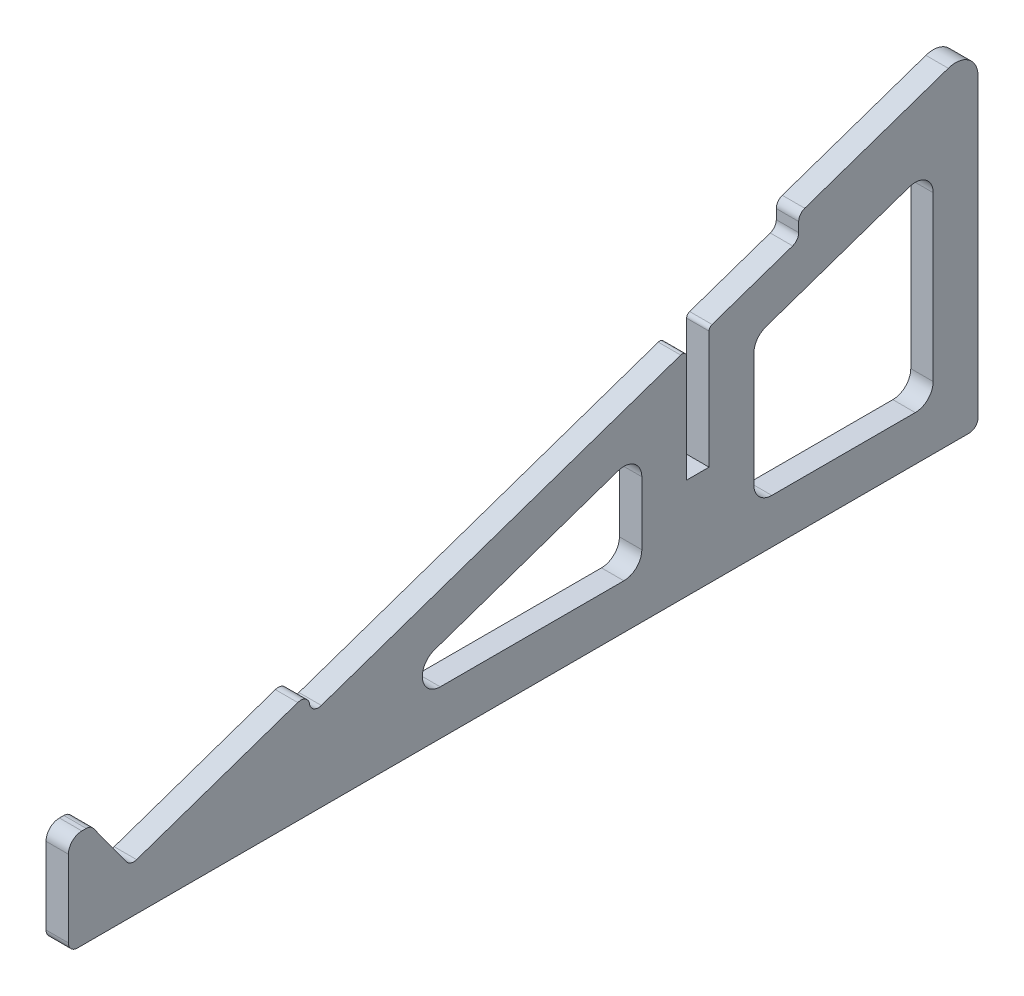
from build123d import *

# Parameters (mm, degrees)
MAIN_BODY_DEPTH  = 6.35
LIP_CUT_DEPTH    = 161.44900373
FILLET1_R        = 2.54
FILLET2_R        = 2.54
FILLET3_R        = 3.81
FILLET4_R        = 6.35
NOTCH_CUT_DEPTH  = 159.944751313
WEIGHT_CUT_DEPTH = 159.944751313
FILLET5_R        = 5.08
FILLET6_R        = 1.27


with BuildPart() as part:
    # Sketch1 → Main Body (new body)
    with BuildSketch(Plane(origin=(0, 0, 0), x_dir=(0, 0, -1), z_dir=(1, 0, 0))):
        Polygon((-128.854513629, 0), (128.854513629, 0), (128.854513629, 95.394311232), (-111.307204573, 12.7), (-122.504513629, 28.111773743), (-128.854513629, 28.111773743), align=None)
    extrude(amount=MAIN_BODY_DEPTH)

    # Sketch2 → Lip Cut (cut, through all)
    with BuildSketch(Plane(origin=(6.35, 0, 0), x_dir=(0, 0, -1), z_dir=(1, 0, 0))):
        Polygon((78.054513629, 77.902468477), (78.054513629, 71.552468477), (-60.507204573, 23.841842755), (-60.507204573, 30.191842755), align=None)
    extrude(amount=-LIP_CUT_DEPTH, mode=Mode.SUBTRACT)

    # Fillet1
    fillet1_edges = [part.edges().sort_by_distance(p)[0] for p in [
        (3.175, 30.191842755, 60.507204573),
        (3.175, 77.902468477, -78.054513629),
    ]]
    fillet(fillet1_edges, radius=FILLET1_R)

    # Fillet2
    fillet2_edges = [part.edges().sort_by_distance(p)[0] for p in [
        (3.175, 12.7, 111.307204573),
        (3.175, 71.552468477, -78.054513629),
        (3.175, 23.841842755, 60.507204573),
        (3.175, 28.111773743, 122.504513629),
        (3.175, 0, -128.854513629),
        (3.175, 0, 128.854513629),
    ]]
    fillet(fillet2_edges, radius=FILLET2_R)

    # Fillet3
    fillet3_edges = [part.edges().sort_by_distance(p)[0] for p in [
        (3.175, 28.111773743, 128.854513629),
    ]]
    fillet(fillet3_edges, radius=FILLET3_R)

    # Fillet4
    fillet4_edges = [part.edges().sort_by_distance(p)[0] for p in [
        (3.175, 95.394311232, -128.854513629),
    ]]
    fillet(fillet4_edges, radius=FILLET4_R)

    # Sketch3 → Notch Cut (cut, through all)
    with BuildSketch(Plane(origin=(6.35, 0, 0), x_dir=(0, 0, -1), z_dir=(1, 0, 0))):
        Polygon((52.654513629, 62.806547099), (52.654513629, 28.516547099), (46.304513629, 28.516547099), (46.304513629, 60.620066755), align=None)
    extrude(amount=-NOTCH_CUT_DEPTH, mode=Mode.SUBTRACT)

    # Sketch4 → Weight Cut (cut, through all)
    with BuildSketch(Plane(origin=(6.35, 0, 0), x_dir=(0, 0, -1), z_dir=(1, 0, 0))):
        Polygon((65.354513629, 53.747725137), (65.354513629, 12.7), (116.154513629, 12.7), (116.154513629, 71.239567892), align=None)
        Polygon((33.604513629, 42.815323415), (33.604513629, 12.7), (-53.856736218, 12.7), align=None)
    extrude(amount=-WEIGHT_CUT_DEPTH, mode=Mode.SUBTRACT)

    # Fillet5
    fillet5_edges = [part.edges().sort_by_distance(p)[0] for p in [
        (3.175, 53.747725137, -65.354513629),
        (3.175, 71.239567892, -116.154513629),
        (3.175, 12.7, -116.154513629),
        (3.175, 12.7, -65.354513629),
        (3.175, 12.7, 53.856736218),
        (3.175, 42.815323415, -33.604513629),
        (3.175, 12.7, -33.604513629),
    ]]
    fillet(fillet5_edges, radius=FILLET5_R)

    # Fillet6
    fillet6_edges = [part.edges().sort_by_distance(p)[0] for p in [
        (3.175, 60.620066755, -46.304513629),
        (3.175, 62.806547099, -52.654513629),
    ]]
    fillet(fillet6_edges, radius=FILLET6_R)


solid = part.part
